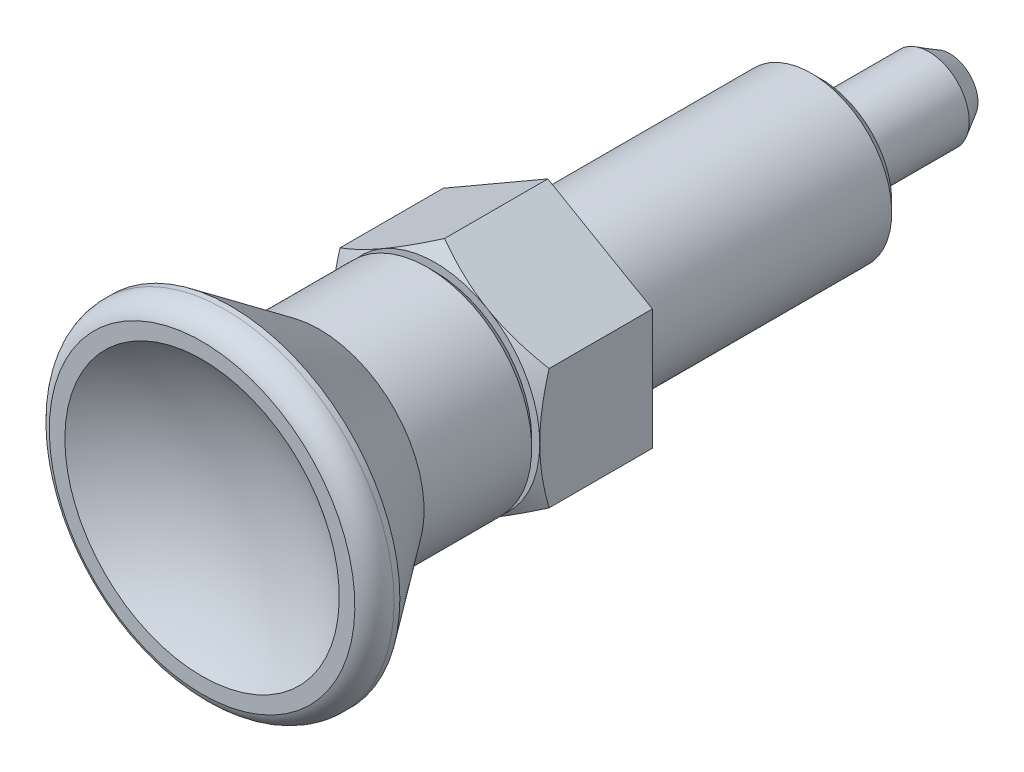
ISO-10303-21;
HEADER;
FILE_DESCRIPTION(('STEP AP214'),'2;1');
FILE_NAME('part.step','',(''),(''),'','','');
FILE_SCHEMA(('AUTOMOTIVE_DESIGN { 1 0 10303 214 1 1 1 1 }'));
ENDSEC;
DATA;
#1=APPLICATION_CONTEXT('core data for automotive mechanical design processes');
#2=APPLICATION_PROTOCOL_DEFINITION('international standard','automotive_design',2000,#1);
#3=PRODUCT_CONTEXT('',#1,'mechanical');
#4=PRODUCT('Part','Part','',(#3));
#5=PRODUCT_RELATED_PRODUCT_CATEGORY('part','',(#4));
#6=PRODUCT_DEFINITION_FORMATION('','',#4);
#7=PRODUCT_DEFINITION_CONTEXT('part definition',#1,'design');
#8=PRODUCT_DEFINITION('design','',#6,#7);
#9=PRODUCT_DEFINITION_SHAPE('','',#8);
#10=(LENGTH_UNIT() NAMED_UNIT(*) SI_UNIT(.MILLI.,.METRE.));
#11=(NAMED_UNIT(*) PLANE_ANGLE_UNIT() SI_UNIT($,.RADIAN.));
#12=(NAMED_UNIT(*) SI_UNIT($,.STERADIAN.) SOLID_ANGLE_UNIT());
#13=UNCERTAINTY_MEASURE_WITH_UNIT(LENGTH_MEASURE(1.E-05),#10,'distance_accuracy_value','');
#14=(GEOMETRIC_REPRESENTATION_CONTEXT(3) GLOBAL_UNCERTAINTY_ASSIGNED_CONTEXT((#13)) GLOBAL_UNIT_ASSIGNED_CONTEXT((#10,
#11,#12)) REPRESENTATION_CONTEXT('',''));
#15=CARTESIAN_POINT('',(0.,0.,0.));
#16=DIRECTION('',(0.,0.,1.));
#17=DIRECTION('',(1.,0.,0.));
#18=AXIS2_PLACEMENT_3D('',#15,#16,#17);
#19=CARTESIAN_POINT('',(0.,0.,5.2679491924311));
#20=DIRECTION('',(0.,0.,-1.));
#21=DIRECTION('',(0.,1.,0.));
#22=AXIS2_PLACEMENT_3D('',#19,#20,#21);
#23=CONICAL_SURFACE('',#22,9.5,1.04719755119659);
#24=CARTESIAN_POINT('',(-6.5,10.1135208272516,3.81175608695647));
#25=CARTESIAN_POINT('',(-6.5,9.82935034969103,3.94973702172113));
#26=CARTESIAN_POINT('',(-6.5,9.54453109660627,4.08640451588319));
#27=CARTESIAN_POINT('',(-6.5,8.97325017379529,4.35637460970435));
#28=CARTESIAN_POINT('',(-6.5,8.68678825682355,4.48967668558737));
#29=CARTESIAN_POINT('',(-6.5,8.11041696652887,4.75284152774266));
#30=CARTESIAN_POINT('',(-6.5,7.8204973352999,4.88268190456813));
#31=CARTESIAN_POINT('',(-6.5,7.23836377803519,5.13709346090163));
#32=CARTESIAN_POINT('',(-6.5,6.94614996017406,5.26166488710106));
#33=CARTESIAN_POINT('',(-6.5,6.34939053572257,5.50810187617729));
#34=CARTESIAN_POINT('',(-6.5,6.04475338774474,5.62974696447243));
#35=CARTESIAN_POINT('',(-6.5,5.43192693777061,5.86391042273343));
#36=CARTESIAN_POINT('',(-6.5,5.12373724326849,5.97642777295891));
#37=CARTESIAN_POINT('',(-6.5,4.50388286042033,6.18940644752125));
#38=CARTESIAN_POINT('',(-6.5,4.19222654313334,6.28989189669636));
#39=CARTESIAN_POINT('',(-6.5,3.56443984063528,6.47560299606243));
#40=CARTESIAN_POINT('',(-6.5,3.2483108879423,6.56083341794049));
#41=CARTESIAN_POINT('',(-6.5,2.61318438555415,6.7115124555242));
#42=CARTESIAN_POINT('',(-6.5,2.29421310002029,6.77707001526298));
#43=CARTESIAN_POINT('',(-6.5,1.65222382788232,6.88470964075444));
#44=CARTESIAN_POINT('',(-6.5,1.32920623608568,6.92679397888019));
#45=CARTESIAN_POINT('',(-6.5,0.845079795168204,6.96952256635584));
#46=CARTESIAN_POINT('',(-6.5,0.684830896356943,6.98035981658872));
#47=CARTESIAN_POINT('',(-6.5,0.364011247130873,6.99525189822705));
#48=CARTESIAN_POINT('',(-6.5,0.203440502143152,6.99930684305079));
#49=CARTESIAN_POINT('',(-6.5,-0.117726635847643,7.00053001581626));
#50=CARTESIAN_POINT('',(-6.5,-0.278323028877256,6.99769823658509));
#51=CARTESIAN_POINT('',(-6.5,-0.599253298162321,6.98521963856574));
#52=CARTESIAN_POINT('',(-6.5,-0.759587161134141,6.97557248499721));
#53=CARTESIAN_POINT('',(-6.5,-1.14392607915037,6.94448274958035));
#54=CARTESIAN_POINT('',(-6.5,-1.36767946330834,6.91986134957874));
#55=CARTESIAN_POINT('',(-6.5,-1.81353669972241,6.85868030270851));
#56=CARTESIAN_POINT('',(-6.5,-2.03564032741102,6.82211905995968));
#57=CARTESIAN_POINT('',(-6.5,-2.69921711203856,6.69646317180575));
#58=CARTESIAN_POINT('',(-6.5,-3.13771059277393,6.59141887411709));
#59=CARTESIAN_POINT('',(-6.5,-3.79339853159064,6.40912052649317));
#60=CARTESIAN_POINT('',(-6.5,-4.01399055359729,6.34338257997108));
#61=CARTESIAN_POINT('',(-6.5,-4.4530325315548,6.20504191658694));
#62=CARTESIAN_POINT('',(-6.5,-4.67148247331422,6.13243915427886));
#63=CARTESIAN_POINT('',(-6.5,-5.10630803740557,5.98153678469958));
#64=CARTESIAN_POINT('',(-6.5,-5.32268430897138,5.90323903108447));
#65=CARTESIAN_POINT('',(-6.5,-5.75364187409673,5.74187158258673));
#66=CARTESIAN_POINT('',(-6.5,-5.96822318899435,5.65880194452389));
#67=CARTESIAN_POINT('',(-6.5,-6.47567680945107,5.45689655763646));
#68=CARTESIAN_POINT('',(-6.5,-6.76784492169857,5.33629419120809));
#69=CARTESIAN_POINT('',(-6.5,-7.34967886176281,5.08917991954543));
#70=CARTESIAN_POINT('',(-6.5,-7.6393445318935,4.96266764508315));
#71=CARTESIAN_POINT('',(-6.5,-8.21663477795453,4.7049231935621));
#72=CARTESIAN_POINT('',(-6.5,-8.5042589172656,4.57369004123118));
#73=CARTESIAN_POINT('',(-6.5,-9.07775904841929,4.30745118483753));
#74=CARTESIAN_POINT('',(-6.5,-9.36363500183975,4.17244539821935));
#75=CARTESIAN_POINT('',(-6.5,-9.93423055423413,3.8992253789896));
#76=CARTESIAN_POINT('',(-6.5,-10.2189485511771,3.76100780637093));
#77=CARTESIAN_POINT('',(-6.5,-10.7871485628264,3.48205273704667));
#78=CARTESIAN_POINT('',(-6.5,-11.0706305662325,3.34131521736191));
#79=CARTESIAN_POINT('',(-6.5,-11.9194411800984,2.91603342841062));
#80=CARTESIAN_POINT('',(-6.5,-12.4832128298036,2.6283820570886));
#81=CARTESIAN_POINT('',(-6.5,-13.5602729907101,2.07178894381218));
#82=CARTESIAN_POINT('',(-6.5,-14.0738056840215,1.80331758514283));
#83=CARTESIAN_POINT('',(-6.5,-15.0989534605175,1.26269618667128));
#84=CARTESIAN_POINT('',(-6.5,-15.6105684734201,0.990546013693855));
#85=CARTESIAN_POINT('',(-6.5,-16.6310038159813,0.444141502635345));
#86=CARTESIAN_POINT('',(-6.5,-17.1398279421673,0.169894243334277));
#87=CARTESIAN_POINT('',(-6.5,-18.1562506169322,-0.38079503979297));
#88=CARTESIAN_POINT('',(-6.5,-18.6638492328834,-0.657236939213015));
#89=CARTESIAN_POINT('',(-6.5,-19.170997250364,-0.934497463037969));
#90=B_SPLINE_CURVE_WITH_KNOTS('',3,(#24,#25,#26,#27,#28,#29,#30,#31,#32,#33,#34,#35,#36,#37,#38,
#39,#40,#41,#42,#43,#44,#45,#46,#47,#48,#49,#50,#51,#52,#53,#54,#55,#56,#57,#58,#59,#60,#61,#62,
#63,#64,#65,#66,#67,#68,#69,#70,#71,#72,#73,#74,#75,#76,#77,#78,#79,#80,#81,#82,#83,#84,#85,#86,
#87,#88,#89),.UNSPECIFIED.,.F.,.F.,(4,2,2,2,2,2,2,2,2,2,2,2,2,2,2,2,2,2,2,2,2,2,2,2,2,2,2,2,2,2,
2,2,4),(0.,0.947705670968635,1.89555793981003,2.84851502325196,3.80142743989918,
4.78539370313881,5.7694697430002,6.7515383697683,7.73329927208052,8.7095185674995,
9.68564334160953,10.1673664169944,10.6490814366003,11.1307969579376,11.612536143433,
12.2874673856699,12.9624888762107,14.3132683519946,15.0037467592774,15.694229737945,
16.3844889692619,17.0747399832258,18.0228948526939,18.9711090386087,19.919520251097,
20.8679522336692,21.8174190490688,22.7668945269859,24.6655842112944,26.4039970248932,
28.1424729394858,29.8765439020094,31.6105172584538),.UNSPECIFIED.);
#91=CARTESIAN_POINT('',(-6.5,-3.7527767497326,6.41944341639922));
#92=VERTEX_POINT('',#91);
#93=CARTESIAN_POINT('',(-6.5,0.,7.));
#94=VERTEX_POINT('',#93);
#95=EDGE_CURVE('E9',#92,#94,#90,.F.);
#96=ORIENTED_EDGE('',*,*,#95,.F.);
#97=CARTESIAN_POINT('',(0.000200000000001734,-7.50566896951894,6.41937674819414));
#98=CARTESIAN_POINT('',(-0.142677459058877,-7.42317863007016,6.46699557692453));
#99=CARTESIAN_POINT('',(-0.286087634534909,-7.34038072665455,6.51245329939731));
#100=CARTESIAN_POINT('',(-0.574072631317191,-7.17411251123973,6.59845131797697));
#101=CARTESIAN_POINT('',(-0.718647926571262,-7.09064192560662,6.63898949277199));
#102=CARTESIAN_POINT('',(-1.15468865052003,-6.83889369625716,6.75242899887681));
#103=CARTESIAN_POINT('',(-1.44787528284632,-6.66962231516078,6.81695219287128));
#104=CARTESIAN_POINT('',(-1.88662374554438,-6.41631077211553,6.89261341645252));
#105=CARTESIAN_POINT('',(-2.03087463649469,-6.33302748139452,6.91416714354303));
#106=CARTESIAN_POINT('',(-2.32002821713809,-6.16608458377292,6.95030968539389));
#107=CARTESIAN_POINT('',(-2.46493084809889,-6.08242501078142,6.96489911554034));
#108=CARTESIAN_POINT('',(-2.75498777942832,-5.91496056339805,6.98674124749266));
#109=CARTESIAN_POINT('',(-2.90014160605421,-5.83115596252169,6.9940022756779));
#110=CARTESIAN_POINT('',(-3.19057533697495,-5.66347396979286,7.00103969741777));
#111=CARTESIAN_POINT('',(-3.33585523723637,-5.5795965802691,7.00081632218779));
#112=CARTESIAN_POINT('',(-3.7338759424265,-5.34979921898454,6.98991654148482));
#113=CARTESIAN_POINT('',(-3.98648646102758,-5.20395446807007,6.97161818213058));
#114=CARTESIAN_POINT('',(-4.49002967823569,-4.91323365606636,6.91359365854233));
#115=CARTESIAN_POINT('',(-4.74096060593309,-4.76835861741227,6.87384766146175));
#116=CARTESIAN_POINT('',(-5.24551722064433,-4.47705272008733,6.77449409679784));
#117=CARTESIAN_POINT('',(-5.49907924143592,-4.33065861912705,6.71446557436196));
#118=CARTESIAN_POINT('',(-6.00242193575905,-4.04005357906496,6.57822500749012));
#119=CARTESIAN_POINT('',(-6.25220905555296,-3.89583891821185,6.50204496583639));
#120=CARTESIAN_POINT('',(-6.5002,-3.75266127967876,6.41937674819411));
#121=B_SPLINE_CURVE_WITH_KNOTS('',3,(#97,#98,#99,#100,#101,#102,#103,#104,#105,#106,#107,#108,
#109,#110,#111,#112,#113,#114,#115,#116,#117,#118,#119,#120),.UNSPECIFIED.,.F.,.F.,(4,2,2,2,2,2,
2,2,2,2,2,4),(0.,0.515105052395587,1.03043143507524,2.06322554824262,2.56697389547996,
3.07067772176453,3.57380860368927,4.0769239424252,4.95279354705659,5.82947446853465,
6.72559912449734,7.61996451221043),.UNSPECIFIED.);
#122=CARTESIAN_POINT('',(-3.24999999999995,-5.62916512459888,7.));
#123=VERTEX_POINT('',#122);
#124=EDGE_CURVE('E201',#123,#92,#121,.T.);
#125=ORIENTED_EDGE('',*,*,#124,.F.);
#126=CARTESIAN_POINT('',(0.,0.,7.));
#127=DIRECTION('',(0.,0.,1.));
#128=DIRECTION('',(0.,-1.,0.));
#129=AXIS2_PLACEMENT_3D('',#126,#127,#128);
#130=CIRCLE('',#129,6.5);
#131=EDGE_CURVE('E259',#94,#123,#130,.T.);
#132=ORIENTED_EDGE('',*,*,#131,.F.);
#133=EDGE_LOOP('',(#96,#125,#132));
#134=FACE_BOUND('',#133,.T.);
#135=ADVANCED_FACE('F14',(#134),#23,.T.);
#136=CARTESIAN_POINT('',(-6.5,3.7527767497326,6.41944341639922));
#137=VERTEX_POINT('',#136);
#138=EDGE_CURVE('E18',#94,#137,#90,.F.);
#139=ORIENTED_EDGE('',*,*,#138,.F.);
#140=CARTESIAN_POINT('',(-3.24999999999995,5.62916512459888,7.));
#141=VERTEX_POINT('',#140);
#142=EDGE_CURVE('E116',#141,#94,#130,.T.);
#143=ORIENTED_EDGE('',*,*,#142,.F.);
#144=CARTESIAN_POINT('',(-6.5002,3.75266127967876,6.41937674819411));
#145=CARTESIAN_POINT('',(-6.35732254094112,3.83515161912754,6.4669955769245));
#146=CARTESIAN_POINT('',(-6.21391236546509,3.91794952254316,6.51245329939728));
#147=CARTESIAN_POINT('',(-5.9259273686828,4.08421773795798,6.59845131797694));
#148=CARTESIAN_POINT('',(-5.78135207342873,4.16768832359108,6.63898949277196));
#149=CARTESIAN_POINT('',(-5.34531134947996,4.41943655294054,6.75242899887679));
#150=CARTESIAN_POINT('',(-5.05212471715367,4.58870793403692,6.81695219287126));
#151=CARTESIAN_POINT('',(-4.61337625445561,4.84201947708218,6.89261341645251));
#152=CARTESIAN_POINT('',(-4.46912536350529,4.92530276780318,6.91416714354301));
#153=CARTESIAN_POINT('',(-4.17997178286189,5.09224566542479,6.95030968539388));
#154=CARTESIAN_POINT('',(-4.03506915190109,5.17590523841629,6.96489911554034));
#155=CARTESIAN_POINT('',(-3.74501222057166,5.34336968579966,6.98674124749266));
#156=CARTESIAN_POINT('',(-3.59985839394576,5.42717428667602,6.9940022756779));
#157=CARTESIAN_POINT('',(-3.30942466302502,5.59485627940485,7.00103969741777));
#158=CARTESIAN_POINT('',(-3.16414476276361,5.67873366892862,7.0008163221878));
#159=CARTESIAN_POINT('',(-2.76612405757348,5.90853103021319,6.98991654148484));
#160=CARTESIAN_POINT('',(-2.5135135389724,6.05437578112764,6.97161818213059));
#161=CARTESIAN_POINT('',(-2.0099703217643,6.34509659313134,6.91359365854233));
#162=CARTESIAN_POINT('',(-1.7590393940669,6.48997163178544,6.87384766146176));
#163=CARTESIAN_POINT('',(-1.25448277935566,6.78127752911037,6.77449409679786));
#164=CARTESIAN_POINT('',(-1.00092075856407,6.92767163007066,6.71446557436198));
#165=CARTESIAN_POINT('',(-0.497578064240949,7.21827667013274,6.57822500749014));
#166=CARTESIAN_POINT('',(-0.247790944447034,7.36249133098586,6.50204496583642));
#167=CARTESIAN_POINT('',(0.000199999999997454,7.50566896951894,6.41937674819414));
#168=B_SPLINE_CURVE_WITH_KNOTS('',3,(#144,#145,#146,#147,#148,#149,#150,#151,#152,#153,#154,
#155,#156,#157,#158,#159,#160,#161,#162,#163,#164,#165,#166,#167),.UNSPECIFIED.,.F.,.F.,(4,2,2,
2,2,2,2,2,2,2,2,4),(0.,0.515105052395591,1.03043143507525,2.06322554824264,2.56697389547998,
3.07067772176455,3.5738086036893,4.07692394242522,4.95279354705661,5.82947446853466,
6.72559912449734,7.61996451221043),.UNSPECIFIED.);
#169=EDGE_CURVE('E262',#137,#141,#168,.T.);
#170=ORIENTED_EDGE('',*,*,#169,.F.);
#171=EDGE_LOOP('',(#139,#143,#170));
#172=FACE_BOUND('',#171,.T.);
#173=ADVANCED_FACE('F223',(#172),#23,.T.);
#174=CARTESIAN_POINT('',(0.,7.5055534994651,6.41944341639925));
#175=VERTEX_POINT('',#174);
#176=EDGE_CURVE('E112',#141,#175,#168,.T.);
#177=ORIENTED_EDGE('',*,*,#176,.F.);
#178=CARTESIAN_POINT('',(3.24999999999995,5.62916512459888,7.));
#179=VERTEX_POINT('',#178);
#180=EDGE_CURVE('E110',#179,#141,#130,.T.);
#181=ORIENTED_EDGE('',*,*,#180,.F.);
#182=CARTESIAN_POINT('',(-0.000200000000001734,7.50566896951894,6.41937674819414));
#183=CARTESIAN_POINT('',(0.142677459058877,7.42317863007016,6.46699557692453));
#184=CARTESIAN_POINT('',(0.286087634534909,7.34038072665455,6.51245329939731));
#185=CARTESIAN_POINT('',(0.574072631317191,7.17411251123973,6.59845131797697));
#186=CARTESIAN_POINT('',(0.718647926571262,7.09064192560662,6.63898949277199));
#187=CARTESIAN_POINT('',(1.15468865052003,6.83889369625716,6.75242899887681));
#188=CARTESIAN_POINT('',(1.44787528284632,6.66962231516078,6.81695219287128));
#189=CARTESIAN_POINT('',(1.88662374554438,6.41631077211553,6.89261341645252));
#190=CARTESIAN_POINT('',(2.03087463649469,6.33302748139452,6.91416714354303));
#191=CARTESIAN_POINT('',(2.32002821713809,6.16608458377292,6.95030968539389));
#192=CARTESIAN_POINT('',(2.46493084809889,6.08242501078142,6.96489911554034));
#193=CARTESIAN_POINT('',(2.75498777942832,5.91496056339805,6.98674124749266));
#194=CARTESIAN_POINT('',(2.90014160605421,5.83115596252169,6.9940022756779));
#195=CARTESIAN_POINT('',(3.19057533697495,5.66347396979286,7.00103969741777));
#196=CARTESIAN_POINT('',(3.33585523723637,5.5795965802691,7.00081632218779));
#197=CARTESIAN_POINT('',(3.7338759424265,5.34979921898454,6.98991654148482));
#198=CARTESIAN_POINT('',(3.98648646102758,5.20395446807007,6.97161818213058));
#199=CARTESIAN_POINT('',(4.49002967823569,4.91323365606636,6.91359365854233));
#200=CARTESIAN_POINT('',(4.74096060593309,4.76835861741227,6.87384766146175));
#201=CARTESIAN_POINT('',(5.24551722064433,4.47705272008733,6.77449409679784));
#202=CARTESIAN_POINT('',(5.49907924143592,4.33065861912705,6.71446557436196));
#203=CARTESIAN_POINT('',(6.00242193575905,4.04005357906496,6.57822500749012));
#204=CARTESIAN_POINT('',(6.25220905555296,3.89583891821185,6.50204496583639));
#205=CARTESIAN_POINT('',(6.5002,3.75266127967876,6.41937674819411));
#206=B_SPLINE_CURVE_WITH_KNOTS('',3,(#182,#183,#184,#185,#186,#187,#188,#189,#190,#191,#192,
#193,#194,#195,#196,#197,#198,#199,#200,#201,#202,#203,#204,#205),.UNSPECIFIED.,.F.,.F.,(4,2,2,
2,2,2,2,2,2,2,2,4),(0.,0.515105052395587,1.03043143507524,2.06322554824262,2.56697389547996,
3.07067772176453,3.57380860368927,4.0769239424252,4.95279354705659,5.82947446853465,
6.72559912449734,7.61996451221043),.UNSPECIFIED.);
#207=EDGE_CURVE('E90',#175,#179,#206,.T.);
#208=ORIENTED_EDGE('',*,*,#207,.F.);
#209=EDGE_LOOP('',(#177,#181,#208));
#210=FACE_BOUND('',#209,.T.);
#211=ADVANCED_FACE('F111',(#210),#23,.T.);
#212=CARTESIAN_POINT('',(0.,-7.5055534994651,6.41944341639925));
#213=VERTEX_POINT('',#212);
#214=EDGE_CURVE('E196',#213,#123,#121,.T.);
#215=ORIENTED_EDGE('',*,*,#214,.F.);
#216=CARTESIAN_POINT('',(6.5002,-3.75266127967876,6.41937674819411));
#217=CARTESIAN_POINT('',(6.35732254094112,-3.83515161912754,6.4669955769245));
#218=CARTESIAN_POINT('',(6.21391236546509,-3.91794952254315,6.51245329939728));
#219=CARTESIAN_POINT('',(5.9259273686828,-4.08421773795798,6.59845131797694));
#220=CARTESIAN_POINT('',(5.78135207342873,-4.16768832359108,6.63898949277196));
#221=CARTESIAN_POINT('',(5.34531134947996,-4.41943655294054,6.75242899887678));
#222=CARTESIAN_POINT('',(5.05212471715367,-4.58870793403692,6.81695219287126));
#223=CARTESIAN_POINT('',(4.61337625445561,-4.84201947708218,6.89261341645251));
#224=CARTESIAN_POINT('',(4.46912536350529,-4.92530276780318,6.91416714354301));
#225=CARTESIAN_POINT('',(4.17997178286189,-5.09224566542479,6.95030968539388));
#226=CARTESIAN_POINT('',(4.03506915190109,-5.17590523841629,6.96489911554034));
#227=CARTESIAN_POINT('',(3.74501222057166,-5.34336968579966,6.98674124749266));
#228=CARTESIAN_POINT('',(3.59985839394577,-5.42717428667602,6.9940022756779));
#229=CARTESIAN_POINT('',(3.30942466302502,-5.59485627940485,7.00103969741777));
#230=CARTESIAN_POINT('',(3.16414476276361,-5.67873366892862,7.0008163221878));
#231=CARTESIAN_POINT('',(2.76612405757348,-5.90853103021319,6.98991654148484));
#232=CARTESIAN_POINT('',(2.5135135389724,-6.05437578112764,6.97161818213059));
#233=CARTESIAN_POINT('',(2.0099703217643,-6.34509659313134,6.91359365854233));
#234=CARTESIAN_POINT('',(1.7590393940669,-6.48997163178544,6.87384766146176));
#235=CARTESIAN_POINT('',(1.25448277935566,-6.78127752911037,6.77449409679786));
#236=CARTESIAN_POINT('',(1.00092075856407,-6.92767163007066,6.71446557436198));
#237=CARTESIAN_POINT('',(0.497578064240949,-7.21827667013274,6.57822500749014));
#238=CARTESIAN_POINT('',(0.247790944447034,-7.36249133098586,6.50204496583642));
#239=CARTESIAN_POINT('',(-0.000199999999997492,-7.50566896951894,6.41937674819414));
#240=B_SPLINE_CURVE_WITH_KNOTS('',3,(#216,#217,#218,#219,#220,#221,#222,#223,#224,#225,#226,
#227,#228,#229,#230,#231,#232,#233,#234,#235,#236,#237,#238,#239),.UNSPECIFIED.,.F.,.F.,(4,2,2,
2,2,2,2,2,2,2,2,4),(0.,0.515105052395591,1.03043143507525,2.06322554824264,2.56697389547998,
3.07067772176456,3.5738086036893,4.07692394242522,4.95279354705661,5.82947446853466,
6.72559912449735,7.61996451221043),.UNSPECIFIED.);
#241=CARTESIAN_POINT('',(3.24999999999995,-5.62916512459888,7.));
#242=VERTEX_POINT('',#241);
#243=EDGE_CURVE('E100',#242,#213,#240,.T.);
#244=ORIENTED_EDGE('',*,*,#243,.F.);
#245=EDGE_CURVE('E123',#123,#242,#130,.T.);
#246=ORIENTED_EDGE('',*,*,#245,.F.);
#247=EDGE_LOOP('',(#215,#244,#246));
#248=FACE_BOUND('',#247,.T.);
#249=ADVANCED_FACE('F241',(#248),#23,.T.);
#250=CARTESIAN_POINT('',(6.5,3.7527767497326,6.41944341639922));
#251=VERTEX_POINT('',#250);
#252=EDGE_CURVE('E94',#179,#251,#206,.T.);
#253=ORIENTED_EDGE('',*,*,#252,.F.);
#254=CARTESIAN_POINT('',(6.5,0.,7.));
#255=VERTEX_POINT('',#254);
#256=EDGE_CURVE('E106',#255,#179,#130,.T.);
#257=ORIENTED_EDGE('',*,*,#256,.F.);
#258=CARTESIAN_POINT('',(6.5,10.1135208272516,3.81175608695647));
#259=CARTESIAN_POINT('',(6.5,9.82935034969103,3.94973702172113));
#260=CARTESIAN_POINT('',(6.5,9.54453109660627,4.08640451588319));
#261=CARTESIAN_POINT('',(6.5,8.97325017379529,4.35637460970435));
#262=CARTESIAN_POINT('',(6.5,8.68678825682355,4.48967668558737));
#263=CARTESIAN_POINT('',(6.5,8.11041696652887,4.75284152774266));
#264=CARTESIAN_POINT('',(6.5,7.8204973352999,4.88268190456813));
#265=CARTESIAN_POINT('',(6.5,7.23836377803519,5.13709346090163));
#266=CARTESIAN_POINT('',(6.5,6.94614996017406,5.26166488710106));
#267=CARTESIAN_POINT('',(6.5,6.34939053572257,5.50810187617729));
#268=CARTESIAN_POINT('',(6.5,6.04475338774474,5.62974696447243));
#269=CARTESIAN_POINT('',(6.5,5.43192693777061,5.86391042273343));
#270=CARTESIAN_POINT('',(6.5,5.12373724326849,5.97642777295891));
#271=CARTESIAN_POINT('',(6.5,4.50388286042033,6.18940644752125));
#272=CARTESIAN_POINT('',(6.5,4.19222654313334,6.28989189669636));
#273=CARTESIAN_POINT('',(6.5,3.56443984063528,6.47560299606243));
#274=CARTESIAN_POINT('',(6.5,3.2483108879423,6.56083341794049));
#275=CARTESIAN_POINT('',(6.5,2.61318438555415,6.7115124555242));
#276=CARTESIAN_POINT('',(6.5,2.29421310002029,6.77707001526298));
#277=CARTESIAN_POINT('',(6.5,1.65222382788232,6.88470964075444));
#278=CARTESIAN_POINT('',(6.5,1.32920623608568,6.92679397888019));
#279=CARTESIAN_POINT('',(6.5,0.845079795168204,6.96952256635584));
#280=CARTESIAN_POINT('',(6.5,0.684830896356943,6.98035981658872));
#281=CARTESIAN_POINT('',(6.5,0.364011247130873,6.99525189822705));
#282=CARTESIAN_POINT('',(6.5,0.203440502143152,6.99930684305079));
#283=CARTESIAN_POINT('',(6.5,-0.117726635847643,7.00053001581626));
#284=CARTESIAN_POINT('',(6.5,-0.278323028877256,6.99769823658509));
#285=CARTESIAN_POINT('',(6.5,-0.599253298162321,6.98521963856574));
#286=CARTESIAN_POINT('',(6.5,-0.759587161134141,6.97557248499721));
#287=CARTESIAN_POINT('',(6.5,-1.14392607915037,6.94448274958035));
#288=CARTESIAN_POINT('',(6.5,-1.36767946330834,6.91986134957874));
#289=CARTESIAN_POINT('',(6.5,-1.81353669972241,6.85868030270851));
#290=CARTESIAN_POINT('',(6.5,-2.03564032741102,6.82211905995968));
#291=CARTESIAN_POINT('',(6.5,-2.69921711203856,6.69646317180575));
#292=CARTESIAN_POINT('',(6.5,-3.13771059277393,6.59141887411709));
#293=CARTESIAN_POINT('',(6.5,-3.79339853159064,6.40912052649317));
#294=CARTESIAN_POINT('',(6.5,-4.01399055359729,6.34338257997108));
#295=CARTESIAN_POINT('',(6.5,-4.4530325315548,6.20504191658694));
#296=CARTESIAN_POINT('',(6.5,-4.67148247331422,6.13243915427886));
#297=CARTESIAN_POINT('',(6.5,-5.10630803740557,5.98153678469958));
#298=CARTESIAN_POINT('',(6.5,-5.32268430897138,5.90323903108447));
#299=CARTESIAN_POINT('',(6.5,-5.75364187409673,5.74187158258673));
#300=CARTESIAN_POINT('',(6.5,-5.96822318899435,5.65880194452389));
#301=CARTESIAN_POINT('',(6.5,-6.47567680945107,5.45689655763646));
#302=CARTESIAN_POINT('',(6.5,-6.76784492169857,5.33629419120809));
#303=CARTESIAN_POINT('',(6.5,-7.34967886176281,5.08917991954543));
#304=CARTESIAN_POINT('',(6.5,-7.6393445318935,4.96266764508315));
#305=CARTESIAN_POINT('',(6.5,-8.21663477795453,4.7049231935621));
#306=CARTESIAN_POINT('',(6.5,-8.5042589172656,4.57369004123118));
#307=CARTESIAN_POINT('',(6.5,-9.07775904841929,4.30745118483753));
#308=CARTESIAN_POINT('',(6.5,-9.36363500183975,4.17244539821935));
#309=CARTESIAN_POINT('',(6.5,-9.93423055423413,3.8992253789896));
#310=CARTESIAN_POINT('',(6.5,-10.2189485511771,3.76100780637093));
#311=CARTESIAN_POINT('',(6.5,-10.7871485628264,3.48205273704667));
#312=CARTESIAN_POINT('',(6.5,-11.0706305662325,3.34131521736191));
#313=CARTESIAN_POINT('',(6.5,-11.9194411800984,2.91603342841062));
#314=CARTESIAN_POINT('',(6.5,-12.4832128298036,2.6283820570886));
#315=CARTESIAN_POINT('',(6.5,-13.5602729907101,2.07178894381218));
#316=CARTESIAN_POINT('',(6.5,-14.0738056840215,1.80331758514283));
#317=CARTESIAN_POINT('',(6.5,-15.0989534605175,1.26269618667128));
#318=CARTESIAN_POINT('',(6.5,-15.6105684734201,0.990546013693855));
#319=CARTESIAN_POINT('',(6.5,-16.6310038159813,0.444141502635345));
#320=CARTESIAN_POINT('',(6.5,-17.1398279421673,0.169894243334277));
#321=CARTESIAN_POINT('',(6.5,-18.1562506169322,-0.38079503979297));
#322=CARTESIAN_POINT('',(6.5,-18.6638492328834,-0.657236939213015));
#323=CARTESIAN_POINT('',(6.5,-19.170997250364,-0.934497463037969));
#324=B_SPLINE_CURVE_WITH_KNOTS('',3,(#258,#259,#260,#261,#262,#263,#264,#265,#266,#267,#268,
#269,#270,#271,#272,#273,#274,#275,#276,#277,#278,#279,#280,#281,#282,#283,#284,#285,#286,#287,
#288,#289,#290,#291,#292,#293,#294,#295,#296,#297,#298,#299,#300,#301,#302,#303,#304,#305,#306,
#307,#308,#309,#310,#311,#312,#313,#314,#315,#316,#317,#318,#319,#320,#321,#322,#323),
.UNSPECIFIED.,.F.,.F.,(4,2,2,2,2,2,2,2,2,2,2,2,2,2,2,2,2,2,2,2,2,2,2,2,2,2,2,2,2,2,2,2,4),(0.,
0.947705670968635,1.89555793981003,2.84851502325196,3.80142743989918,4.78539370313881,
5.7694697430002,6.7515383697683,7.73329927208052,8.7095185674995,9.68564334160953,
10.1673664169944,10.6490814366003,11.1307969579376,11.612536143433,12.2874673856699,
12.9624888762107,14.3132683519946,15.0037467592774,15.694229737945,16.3844889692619,
17.0747399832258,18.0228948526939,18.9711090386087,19.919520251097,20.8679522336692,
21.8174190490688,22.7668945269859,24.6655842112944,26.4039970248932,28.1424729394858,
29.8765439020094,31.6105172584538),.UNSPECIFIED.);
#325=EDGE_CURVE('E41',#251,#255,#324,.T.);
#326=ORIENTED_EDGE('',*,*,#325,.F.);
#327=EDGE_LOOP('',(#253,#257,#326));
#328=FACE_BOUND('',#327,.T.);
#329=ADVANCED_FACE('F104',(#328),#23,.T.);
#330=CARTESIAN_POINT('',(6.5,-3.7527767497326,6.41944341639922));
#331=VERTEX_POINT('',#330);
#332=EDGE_CURVE('E108',#331,#242,#240,.T.);
#333=ORIENTED_EDGE('',*,*,#332,.F.);
#334=EDGE_CURVE('E166',#255,#331,#324,.T.);
#335=ORIENTED_EDGE('',*,*,#334,.F.);
#336=EDGE_CURVE('E121',#242,#255,#130,.T.);
#337=ORIENTED_EDGE('',*,*,#336,.F.);
#338=EDGE_LOOP('',(#333,#335,#337));
#339=FACE_BOUND('',#338,.T.);
#340=ADVANCED_FACE('F225',(#339),#23,.T.);
#341=CARTESIAN_POINT('',(2.28549817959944E-12,0.,32.5999999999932));
#342=DIRECTION('',(0.,0.,1.));
#343=DIRECTION('',(-1.,0.,0.));
#344=AXIS2_PLACEMENT_3D('',#341,#342,#343);
#345=SPHERICAL_SURFACE('',#344,13.9999999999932);
#346=CARTESIAN_POINT('',(0.,0.,21.5));
#347=DIRECTION('',(0.,0.,1.));
#348=DIRECTION('',(0.,-1.,0.));
#349=AXIS2_PLACEMENT_3D('',#346,#347,#348);
#350=CIRCLE('',#349,8.5317055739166);
#351=CARTESIAN_POINT('',(0.,-8.5317055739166,21.5));
#352=VERTEX_POINT('',#351);
#353=EDGE_CURVE('E163',#352,#352,#350,.T.);
#354=ORIENTED_EDGE('',*,*,#353,.T.);
#355=EDGE_LOOP('',(#354));
#356=FACE_BOUND('',#355,.T.);
#357=ADVANCED_FACE('F16',(#356),#345,.F.);
#358=CARTESIAN_POINT('',(8.5317055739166,0.,21.5));
#359=DIRECTION('',(0.,0.,1.));
#360=DIRECTION('',(0.,-1.,0.));
#361=AXIS2_PLACEMENT_3D('',#358,#359,#360);
#362=PLANE('',#361);
#363=CARTESIAN_POINT('',(0.,0.,21.5));
#364=DIRECTION('',(0.,0.,1.));
#365=DIRECTION('',(0.,-1.,0.));
#366=AXIS2_PLACEMENT_3D('',#363,#364,#365);
#367=CIRCLE('',#366,9.5);
#368=CARTESIAN_POINT('',(0.,-9.5,21.5));
#369=VERTEX_POINT('',#368);
#370=EDGE_CURVE('E160',#369,#369,#367,.T.);
#371=ORIENTED_EDGE('',*,*,#370,.T.);
#372=EDGE_LOOP('',(#371));
#373=FACE_BOUND('',#372,.T.);
#374=ORIENTED_EDGE('',*,*,#353,.F.);
#375=EDGE_LOOP('',(#374));
#376=FACE_BOUND('',#375,.T.);
#377=ADVANCED_FACE('F239',(#373,#376),#362,.T.);
#378=CARTESIAN_POINT('',(0.,0.,20.0857085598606));
#379=DIRECTION('',(0.,0.,1.));
#380=DIRECTION('',(0.,-1.,0.));
#381=AXIS2_PLACEMENT_3D('',#378,#379,#380);
#382=TOROIDAL_SURFACE('',#381,9.0002203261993,1.49999999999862);
#383=CARTESIAN_POINT('',(0.,0.,20.06));
#384=DIRECTION('',(0.,0.,1.));
#385=DIRECTION('',(0.,-1.,0.));
#386=AXIS2_PLACEMENT_3D('',#383,#384,#385);
#387=CIRCLE('',#386,10.5);
#388=CARTESIAN_POINT('',(0.,-10.5,20.06));
#389=VERTEX_POINT('',#388);
#390=EDGE_CURVE('E157',#389,#389,#387,.T.);
#391=ORIENTED_EDGE('',*,*,#390,.T.);
#392=EDGE_LOOP('',(#391));
#393=FACE_BOUND('',#392,.T.);
#394=ORIENTED_EDGE('',*,*,#370,.F.);
#395=EDGE_LOOP('',(#394));
#396=FACE_BOUND('',#395,.T.);
#397=ADVANCED_FACE('F335',(#393,#396),#382,.T.);
#398=CARTESIAN_POINT('',(0.,0.,-25.));
#399=DIRECTION('',(0.,0.,1.));
#400=DIRECTION('',(0.,-1.,0.));
#401=AXIS2_PLACEMENT_3D('',#398,#399,#400);
#402=CYLINDRICAL_SURFACE('',#401,10.5);
#403=CARTESIAN_POINT('',(0.,0.,19.7));
#404=DIRECTION('',(0.,0.,1.));
#405=DIRECTION('',(0.,-1.,0.));
#406=AXIS2_PLACEMENT_3D('',#403,#404,#405);
#407=CIRCLE('',#406,10.5);
#408=CARTESIAN_POINT('',(0.,-10.5,19.7));
#409=VERTEX_POINT('',#408);
#410=EDGE_CURVE('E154',#409,#409,#407,.T.);
#411=ORIENTED_EDGE('',*,*,#410,.T.);
#412=EDGE_LOOP('',(#411));
#413=FACE_BOUND('',#412,.T.);
#414=ORIENTED_EDGE('',*,*,#390,.F.);
#415=EDGE_LOOP('',(#414));
#416=FACE_BOUND('',#415,.T.);
#417=ADVANCED_FACE('F331',(#413,#416),#402,.T.);
#418=CARTESIAN_POINT('',(0.,0.,19.7));
#419=DIRECTION('',(0.,0.,1.));
#420=DIRECTION('',(0.,-1.,0.));
#421=AXIS2_PLACEMENT_3D('',#418,#419,#420);
#422=CONICAL_SURFACE('',#421,10.5,0.628318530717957);
#423=CARTESIAN_POINT('',(0.,0.,14.1944723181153));
#424=DIRECTION('',(0.,0.,1.));
#425=DIRECTION('',(0.,-1.,0.));
#426=AXIS2_PLACEMENT_3D('',#423,#424,#425);
#427=CIRCLE('',#426,6.5);
#428=CARTESIAN_POINT('',(0.,-6.5,14.1944723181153));
#429=VERTEX_POINT('',#428);
#430=EDGE_CURVE('E151',#429,#429,#427,.T.);
#431=ORIENTED_EDGE('',*,*,#430,.T.);
#432=EDGE_LOOP('',(#431));
#433=FACE_BOUND('',#432,.T.);
#434=ORIENTED_EDGE('',*,*,#410,.F.);
#435=EDGE_LOOP('',(#434));
#436=FACE_BOUND('',#435,.T.);
#437=ADVANCED_FACE('F327',(#433,#436),#422,.T.);
#438=CARTESIAN_POINT('',(0.,0.,-25.));
#439=DIRECTION('',(0.,0.,1.));
#440=DIRECTION('',(0.,-1.,0.));
#441=AXIS2_PLACEMENT_3D('',#438,#439,#440);
#442=CYLINDRICAL_SURFACE('',#441,6.5);
#443=CARTESIAN_POINT('',(0.,0.,7.5));
#444=DIRECTION('',(0.,0.,1.));
#445=DIRECTION('',(0.,-1.,0.));
#446=AXIS2_PLACEMENT_3D('',#443,#444,#445);
#447=CIRCLE('',#446,6.5);
#448=CARTESIAN_POINT('',(0.,-6.5,7.5));
#449=VERTEX_POINT('',#448);
#450=EDGE_CURVE('E148',#449,#449,#447,.T.);
#451=ORIENTED_EDGE('',*,*,#450,.T.);
#452=EDGE_LOOP('',(#451));
#453=FACE_BOUND('',#452,.T.);
#454=ORIENTED_EDGE('',*,*,#430,.F.);
#455=EDGE_LOOP('',(#454));
#456=FACE_BOUND('',#455,.T.);
#457=ADVANCED_FACE('F323',(#453,#456),#442,.T.);
#458=CARTESIAN_POINT('',(0.,0.,7.5));
#459=DIRECTION('',(0.,0.,1.));
#460=DIRECTION('',(0.,-1.,0.));
#461=AXIS2_PLACEMENT_3D('',#458,#459,#460);
#462=CONICAL_SURFACE('',#461,6.5,0.785398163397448);
#463=CARTESIAN_POINT('',(0.,0.,7.));
#464=DIRECTION('',(0.,0.,1.));
#465=DIRECTION('',(0.,-1.,0.));
#466=AXIS2_PLACEMENT_3D('',#463,#464,#465);
#467=CIRCLE('',#466,6.);
#468=CARTESIAN_POINT('',(0.,-6.,7.));
#469=VERTEX_POINT('',#468);
#470=EDGE_CURVE('E145',#469,#469,#467,.T.);
#471=ORIENTED_EDGE('',*,*,#470,.T.);
#472=EDGE_LOOP('',(#471));
#473=FACE_BOUND('',#472,.T.);
#474=ORIENTED_EDGE('',*,*,#450,.F.);
#475=EDGE_LOOP('',(#474));
#476=FACE_BOUND('',#475,.T.);
#477=ADVANCED_FACE('F312',(#473,#476),#462,.T.);
#478=CARTESIAN_POINT('',(6.5,0.,7.));
#479=DIRECTION('',(0.,0.,-1.));
#480=DIRECTION('',(0.,1.,0.));
#481=AXIS2_PLACEMENT_3D('',#478,#479,#480);
#482=PLANE('',#481);
#483=ORIENTED_EDGE('',*,*,#470,.F.);
#484=EDGE_LOOP('',(#483));
#485=FACE_BOUND('',#484,.T.);
#486=ORIENTED_EDGE('',*,*,#336,.T.);
#487=ORIENTED_EDGE('',*,*,#256,.T.);
#488=ORIENTED_EDGE('',*,*,#180,.T.);
#489=ORIENTED_EDGE('',*,*,#142,.T.);
#490=ORIENTED_EDGE('',*,*,#131,.T.);
#491=ORIENTED_EDGE('',*,*,#245,.T.);
#492=EDGE_LOOP('',(#486,#487,#488,#489,#490,#491));
#493=FACE_BOUND('',#492,.T.);
#494=ADVANCED_FACE('F118',(#485,#493),#482,.F.);
#495=CARTESIAN_POINT('',(6.5,3.7527767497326,-2.));
#496=DIRECTION('',(0.499999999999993,0.866025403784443,0.));
#497=DIRECTION('',(-0.866025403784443,0.499999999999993,0.));
#498=AXIS2_PLACEMENT_3D('',#495,#496,#497);
#499=PLANE('',#498);
#500=DIRECTION('',(-0.866025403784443,0.499999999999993,0.));
#501=VECTOR('',#500,1.);
#502=CARTESIAN_POINT('',(7.,3.4641016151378,0.));
#503=LINE('',#502,#501);
#504=CARTESIAN_POINT('',(6.5,3.7527767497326,0.));
#505=VERTEX_POINT('',#504);
#506=CARTESIAN_POINT('',(0.,7.5055534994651,0.));
#507=VERTEX_POINT('',#506);
#508=EDGE_CURVE('E126',#505,#507,#503,.T.);
#509=ORIENTED_EDGE('',*,*,#508,.T.);
#510=DIRECTION('',(0.,0.,1.));
#511=VECTOR('',#510,1.);
#512=CARTESIAN_POINT('',(0.,7.5055534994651,-2.));
#513=LINE('',#512,#511);
#514=EDGE_CURVE('E96',#507,#175,#513,.T.);
#515=ORIENTED_EDGE('',*,*,#514,.T.);
#516=ORIENTED_EDGE('',*,*,#207,.T.);
#517=ORIENTED_EDGE('',*,*,#252,.T.);
#518=DIRECTION('',(0.,0.,1.));
#519=VECTOR('',#518,1.);
#520=CARTESIAN_POINT('',(6.5,3.7527767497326,-2.));
#521=LINE('',#520,#519);
#522=EDGE_CURVE('E282',#505,#251,#521,.T.);
#523=ORIENTED_EDGE('',*,*,#522,.F.);
#524=EDGE_LOOP('',(#509,#515,#516,#517,#523));
#525=FACE_BOUND('',#524,.T.);
#526=ADVANCED_FACE('F92',(#525),#499,.T.);
#527=CARTESIAN_POINT('',(0.,7.5055534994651,-2.));
#528=DIRECTION('',(-0.499999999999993,0.866025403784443,0.));
#529=DIRECTION('',(-0.866025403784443,-0.499999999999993,0.));
#530=AXIS2_PLACEMENT_3D('',#527,#528,#529);
#531=PLANE('',#530);
#532=DIRECTION('',(-0.866025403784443,-0.499999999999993,0.));
#533=VECTOR('',#532,1.);
#534=CARTESIAN_POINT('',(0.500000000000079,7.79422863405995,0.));
#535=LINE('',#534,#533);
#536=CARTESIAN_POINT('',(-6.5,3.7527767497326,0.));
#537=VERTEX_POINT('',#536);
#538=EDGE_CURVE('E266',#507,#537,#535,.T.);
#539=ORIENTED_EDGE('',*,*,#538,.T.);
#540=DIRECTION('',(0.,0.,1.));
#541=VECTOR('',#540,1.);
#542=CARTESIAN_POINT('',(-6.5,3.7527767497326,-2.));
#543=LINE('',#542,#541);
#544=EDGE_CURVE('E269',#537,#137,#543,.T.);
#545=ORIENTED_EDGE('',*,*,#544,.T.);
#546=ORIENTED_EDGE('',*,*,#169,.T.);
#547=ORIENTED_EDGE('',*,*,#176,.T.);
#548=ORIENTED_EDGE('',*,*,#514,.F.);
#549=EDGE_LOOP('',(#539,#545,#546,#547,#548));
#550=FACE_BOUND('',#549,.T.);
#551=ADVANCED_FACE('F190',(#550),#531,.T.);
#552=CARTESIAN_POINT('',(-6.5,3.7527767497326,-2.));
#553=DIRECTION('',(-1.,0.,0.));
#554=DIRECTION('',(0.,-1.,0.));
#555=AXIS2_PLACEMENT_3D('',#552,#553,#554);
#556=PLANE('',#555);
#557=DIRECTION('',(0.,-1.,0.));
#558=VECTOR('',#557,1.);
#559=CARTESIAN_POINT('',(-6.5,0.,0.));
#560=LINE('',#559,#558);
#561=CARTESIAN_POINT('',(-6.5,-3.7527767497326,0.));
#562=VERTEX_POINT('',#561);
#563=EDGE_CURVE('E275',#537,#562,#560,.T.);
#564=ORIENTED_EDGE('',*,*,#563,.T.);
#565=DIRECTION('',(0.,0.,1.));
#566=VECTOR('',#565,1.);
#567=CARTESIAN_POINT('',(-6.5,-3.7527767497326,-2.));
#568=LINE('',#567,#566);
#569=EDGE_CURVE('E256',#562,#92,#568,.T.);
#570=ORIENTED_EDGE('',*,*,#569,.T.);
#571=ORIENTED_EDGE('',*,*,#95,.T.);
#572=ORIENTED_EDGE('',*,*,#138,.T.);
#573=ORIENTED_EDGE('',*,*,#544,.F.);
#574=EDGE_LOOP('',(#564,#570,#571,#572,#573));
#575=FACE_BOUND('',#574,.T.);
#576=ADVANCED_FACE('F210',(#575),#556,.T.);
#577=CARTESIAN_POINT('',(-6.5,-3.7527767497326,-2.));
#578=DIRECTION('',(-0.499999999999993,-0.866025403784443,0.));
#579=DIRECTION('',(0.866025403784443,-0.499999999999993,0.));
#580=AXIS2_PLACEMENT_3D('',#577,#578,#579);
#581=PLANE('',#580);
#582=DIRECTION('',(0.866025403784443,-0.499999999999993,0.));
#583=VECTOR('',#582,1.);
#584=CARTESIAN_POINT('',(0.500000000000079,-7.79422863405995,0.));
#585=LINE('',#584,#583);
#586=CARTESIAN_POINT('',(0.,-7.5055534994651,0.));
#587=VERTEX_POINT('',#586);
#588=EDGE_CURVE('E255',#562,#587,#585,.T.);
#589=ORIENTED_EDGE('',*,*,#588,.T.);
#590=DIRECTION('',(0.,0.,1.));
#591=VECTOR('',#590,1.);
#592=CARTESIAN_POINT('',(0.,-7.5055534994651,-2.));
#593=LINE('',#592,#591);
#594=EDGE_CURVE('E247',#587,#213,#593,.T.);
#595=ORIENTED_EDGE('',*,*,#594,.T.);
#596=ORIENTED_EDGE('',*,*,#214,.T.);
#597=ORIENTED_EDGE('',*,*,#124,.T.);
#598=ORIENTED_EDGE('',*,*,#569,.F.);
#599=EDGE_LOOP('',(#589,#595,#596,#597,#598));
#600=FACE_BOUND('',#599,.T.);
#601=ADVANCED_FACE('F207',(#600),#581,.T.);
#602=CARTESIAN_POINT('',(0.,-7.5055534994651,-2.));
#603=DIRECTION('',(0.499999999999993,-0.866025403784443,0.));
#604=DIRECTION('',(0.866025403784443,0.499999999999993,0.));
#605=AXIS2_PLACEMENT_3D('',#602,#603,#604);
#606=PLANE('',#605);
#607=DIRECTION('',(0.866025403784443,0.499999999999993,0.));
#608=VECTOR('',#607,1.);
#609=CARTESIAN_POINT('',(7.,-3.4641016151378,0.));
#610=LINE('',#609,#608);
#611=CARTESIAN_POINT('',(6.5,-3.7527767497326,0.));
#612=VERTEX_POINT('',#611);
#613=EDGE_CURVE('E279',#587,#612,#610,.T.);
#614=ORIENTED_EDGE('',*,*,#613,.T.);
#615=DIRECTION('',(0.,0.,1.));
#616=VECTOR('',#615,1.);
#617=CARTESIAN_POINT('',(6.5,-3.7527767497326,-2.));
#618=LINE('',#617,#616);
#619=EDGE_CURVE('E35',#612,#331,#618,.T.);
#620=ORIENTED_EDGE('',*,*,#619,.T.);
#621=ORIENTED_EDGE('',*,*,#332,.T.);
#622=ORIENTED_EDGE('',*,*,#243,.T.);
#623=ORIENTED_EDGE('',*,*,#594,.F.);
#624=EDGE_LOOP('',(#614,#620,#621,#622,#623));
#625=FACE_BOUND('',#624,.T.);
#626=ADVANCED_FACE('F185',(#625),#606,.T.);
#627=CARTESIAN_POINT('',(6.5,-3.7527767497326,-2.));
#628=DIRECTION('',(1.,0.,0.));
#629=DIRECTION('',(0.,1.,0.));
#630=AXIS2_PLACEMENT_3D('',#627,#628,#629);
#631=PLANE('',#630);
#632=DIRECTION('',(0.,1.,0.));
#633=VECTOR('',#632,1.);
#634=CARTESIAN_POINT('',(6.5,0.,0.));
#635=LINE('',#634,#633);
#636=EDGE_CURVE('E268',#612,#505,#635,.T.);
#637=ORIENTED_EDGE('',*,*,#636,.T.);
#638=ORIENTED_EDGE('',*,*,#522,.T.);
#639=ORIENTED_EDGE('',*,*,#325,.T.);
#640=ORIENTED_EDGE('',*,*,#334,.T.);
#641=ORIENTED_EDGE('',*,*,#619,.F.);
#642=EDGE_LOOP('',(#637,#638,#639,#640,#641));
#643=FACE_BOUND('',#642,.T.);
#644=ADVANCED_FACE('F181',(#643),#631,.T.);
#645=CARTESIAN_POINT('',(5.,0.,0.));
#646=DIRECTION('',(0.,0.,1.));
#647=DIRECTION('',(0.,-1.,0.));
#648=AXIS2_PLACEMENT_3D('',#645,#646,#647);
#649=PLANE('',#648);
#650=CARTESIAN_POINT('',(0.,0.,0.));
#651=DIRECTION('',(0.,0.,1.));
#652=DIRECTION('',(0.,-1.,0.));
#653=AXIS2_PLACEMENT_3D('',#650,#651,#652);
#654=CIRCLE('',#653,5.);
#655=CARTESIAN_POINT('',(0.,-5.,0.));
#656=VERTEX_POINT('',#655);
#657=EDGE_CURVE('E122',#656,#656,#654,.T.);
#658=ORIENTED_EDGE('',*,*,#657,.T.);
#659=EDGE_LOOP('',(#658));
#660=FACE_BOUND('',#659,.T.);
#661=ORIENTED_EDGE('',*,*,#508,.F.);
#662=ORIENTED_EDGE('',*,*,#636,.F.);
#663=ORIENTED_EDGE('',*,*,#613,.F.);
#664=ORIENTED_EDGE('',*,*,#588,.F.);
#665=ORIENTED_EDGE('',*,*,#563,.F.);
#666=ORIENTED_EDGE('',*,*,#538,.F.);
#667=EDGE_LOOP('',(#661,#662,#663,#664,#665,#666));
#668=FACE_BOUND('',#667,.T.);
#669=ADVANCED_FACE('F184',(#660,#668),#649,.F.);
#670=CARTESIAN_POINT('',(1.7494446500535,0.,-25.));
#671=DIRECTION('',(0.,0.,-1.));
#672=DIRECTION('',(0.,1.,0.));
#673=AXIS2_PLACEMENT_3D('',#670,#671,#672);
#674=PLANE('',#673);
#675=CARTESIAN_POINT('',(0.,0.,-25.));
#676=DIRECTION('',(0.,0.,1.));
#677=DIRECTION('',(0.,-1.,0.));
#678=AXIS2_PLACEMENT_3D('',#675,#676,#677);
#679=CIRCLE('',#678,1.7494446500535);
#680=CARTESIAN_POINT('',(0.,-1.7494446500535,-25.));
#681=VERTEX_POINT('',#680);
#682=EDGE_CURVE('E139',#681,#681,#679,.T.);
#683=ORIENTED_EDGE('',*,*,#682,.F.);
#684=EDGE_LOOP('',(#683));
#685=FACE_BOUND('',#684,.T.);
#686=ADVANCED_FACE('F288',(#685),#674,.T.);
#687=CARTESIAN_POINT('',(0.,0.,-23.7));
#688=DIRECTION('',(0.,0.,1.));
#689=DIRECTION('',(0.,-1.,0.));
#690=AXIS2_PLACEMENT_3D('',#687,#688,#689);
#691=CONICAL_SURFACE('',#690,2.5,0.523598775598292);
#692=ORIENTED_EDGE('',*,*,#682,.T.);
#693=EDGE_LOOP('',(#692));
#694=FACE_BOUND('',#693,.T.);
#695=CARTESIAN_POINT('',(0.,0.,-23.7));
#696=DIRECTION('',(0.,0.,1.));
#697=DIRECTION('',(0.,-1.,0.));
#698=AXIS2_PLACEMENT_3D('',#695,#696,#697);
#699=CIRCLE('',#698,2.5);
#700=CARTESIAN_POINT('',(0.,-2.5,-23.7));
#701=VERTEX_POINT('',#700);
#702=EDGE_CURVE('E142',#701,#701,#699,.T.);
#703=ORIENTED_EDGE('',*,*,#702,.F.);
#704=EDGE_LOOP('',(#703));
#705=FACE_BOUND('',#704,.T.);
#706=ADVANCED_FACE('F294',(#694,#705),#691,.T.);
#707=CARTESIAN_POINT('',(0.,0.,-25.));
#708=DIRECTION('',(0.,0.,1.));
#709=DIRECTION('',(0.,-1.,0.));
#710=AXIS2_PLACEMENT_3D('',#707,#708,#709);
#711=CYLINDRICAL_SURFACE('',#710,2.5);
#712=ORIENTED_EDGE('',*,*,#702,.T.);
#713=EDGE_LOOP('',(#712));
#714=FACE_BOUND('',#713,.T.);
#715=CARTESIAN_POINT('',(0.,0.,-17.));
#716=DIRECTION('',(0.,0.,1.));
#717=DIRECTION('',(0.,-1.,0.));
#718=AXIS2_PLACEMENT_3D('',#715,#716,#717);
#719=CIRCLE('',#718,2.5);
#720=CARTESIAN_POINT('',(0.,-2.5,-17.));
#721=VERTEX_POINT('',#720);
#722=EDGE_CURVE('E136',#721,#721,#719,.T.);
#723=ORIENTED_EDGE('',*,*,#722,.F.);
#724=EDGE_LOOP('',(#723));
#725=FACE_BOUND('',#724,.T.);
#726=ADVANCED_FACE('F309',(#714,#725),#711,.T.);
#727=CARTESIAN_POINT('',(2.5,0.,-17.));
#728=DIRECTION('',(0.,0.,1.));
#729=DIRECTION('',(0.,-1.,0.));
#730=AXIS2_PLACEMENT_3D('',#727,#728,#729);
#731=PLANE('',#730);
#732=CARTESIAN_POINT('',(0.,0.,-17.));
#733=DIRECTION('',(0.,0.,1.));
#734=DIRECTION('',(0.,-1.,0.));
#735=AXIS2_PLACEMENT_3D('',#732,#733,#734);
#736=CIRCLE('',#735,4.3865);
#737=CARTESIAN_POINT('',(0.,-4.3865,-17.));
#738=VERTEX_POINT('',#737);
#739=EDGE_CURVE('E133',#738,#738,#736,.T.);
#740=ORIENTED_EDGE('',*,*,#739,.F.);
#741=EDGE_LOOP('',(#740));
#742=FACE_BOUND('',#741,.T.);
#743=ORIENTED_EDGE('',*,*,#722,.T.);
#744=EDGE_LOOP('',(#743));
#745=FACE_BOUND('',#744,.T.);
#746=ADVANCED_FACE('F305',(#742,#745),#731,.F.);
#747=CARTESIAN_POINT('',(0.,0.,-17.));
#748=DIRECTION('',(0.,0.,1.));
#749=DIRECTION('',(0.,-1.,0.));
#750=AXIS2_PLACEMENT_3D('',#747,#748,#749);
#751=CONICAL_SURFACE('',#750,4.3865,0.785398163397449);
#752=CARTESIAN_POINT('',(0.,0.,-16.3865));
#753=DIRECTION('',(0.,0.,1.));
#754=DIRECTION('',(0.,-1.,0.));
#755=AXIS2_PLACEMENT_3D('',#752,#753,#754);
#756=CIRCLE('',#755,5.);
#757=CARTESIAN_POINT('',(0.,-5.,-16.3865));
#758=VERTEX_POINT('',#757);
#759=EDGE_CURVE('E130',#758,#758,#756,.T.);
#760=ORIENTED_EDGE('',*,*,#759,.F.);
#761=EDGE_LOOP('',(#760));
#762=FACE_BOUND('',#761,.T.);
#763=ORIENTED_EDGE('',*,*,#739,.T.);
#764=EDGE_LOOP('',(#763));
#765=FACE_BOUND('',#764,.T.);
#766=ADVANCED_FACE('F301',(#762,#765),#751,.T.);
#767=CARTESIAN_POINT('',(0.,0.,-17.));
#768=DIRECTION('',(0.,0.,1.));
#769=DIRECTION('',(0.,-1.,0.));
#770=AXIS2_PLACEMENT_3D('',#767,#768,#769);
#771=CYLINDRICAL_SURFACE('',#770,5.);
#772=ORIENTED_EDGE('',*,*,#759,.T.);
#773=EDGE_LOOP('',(#772));
#774=FACE_BOUND('',#773,.T.);
#775=ORIENTED_EDGE('',*,*,#657,.F.);
#776=EDGE_LOOP('',(#775));
#777=FACE_BOUND('',#776,.T.);
#778=ADVANCED_FACE('F298',(#774,#777),#771,.T.);
#779=CLOSED_SHELL('',(#135,#173,#211,#249,#329,#340,#357,#377,#397,#417,#437,#457,#477,#494,
#526,#551,#576,#601,#626,#644,#669,#686,#706,#726,#746,#766,#778));
#780=MANIFOLD_SOLID_BREP('B1',#779);
#781=ADVANCED_BREP_SHAPE_REPRESENTATION('',(#18,#780),#14);
#782=SHAPE_DEFINITION_REPRESENTATION(#9,#781);
ENDSEC;
END-ISO-10303-21;
